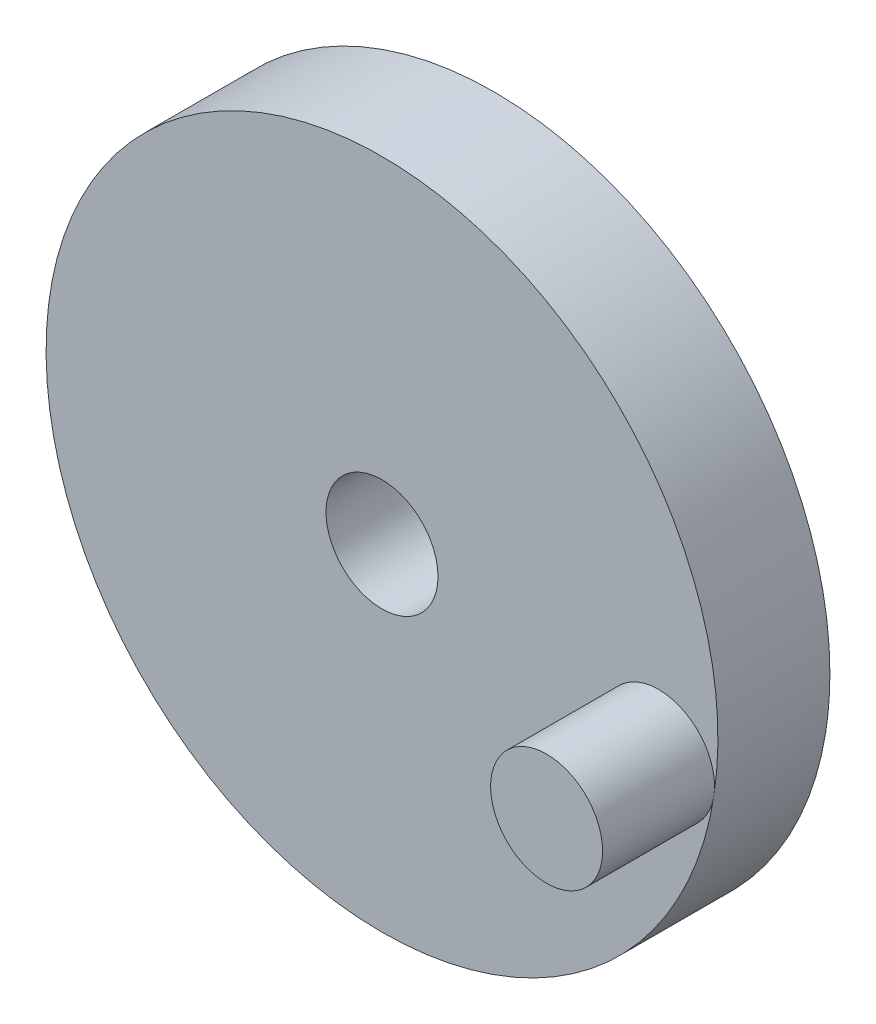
from build123d import *

# Parameters (mm, degrees)
SKETCH1_R           = 30
BOSS_EXTRUDE1_DEPTH = 10
SKETCH2_R           = 5
CUT_EXTRUDE1_DEPTH  = 44.588989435
SKETCH5_R           = 5
BOSS_EXTRUDE3_DEPTH = 10


with BuildPart() as part:
    # Sketch1 → Boss-Extrude1 (new body)
    with BuildSketch(Plane.XY):
        Circle(SKETCH1_R)
    extrude(amount=BOSS_EXTRUDE1_DEPTH)

    # Sketch2 → Cut-Extrude1 (cut, through all)
    with BuildSketch(Plane.XY.offset(10)):
        Circle(SKETCH2_R)
    extrude(amount=-CUT_EXTRUDE1_DEPTH, mode=Mode.SUBTRACT)

    # Sketch5 → Boss-Extrude3 (add)
    with BuildSketch(Plane.XY.offset(10)):
        with Locations(Location((24.698767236, -3.869224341, 0), (0, 0, 351.096602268))):
            Circle(SKETCH5_R)
    extrude(amount=BOSS_EXTRUDE3_DEPTH)


solid = part.part
